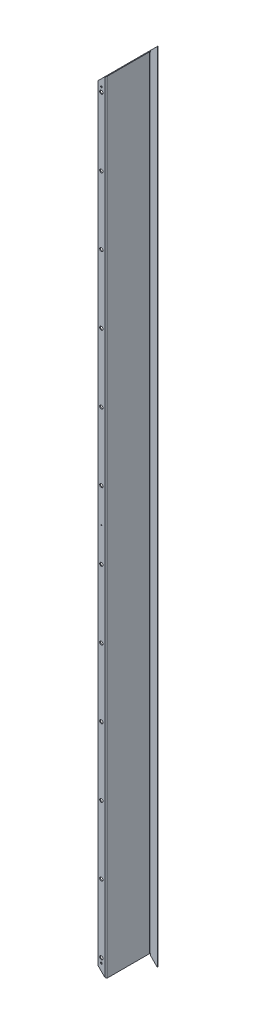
ISO-10303-21;
HEADER;
FILE_DESCRIPTION(('STEP AP214'),'2;1');
FILE_NAME('part.step','',(''),(''),'','','');
FILE_SCHEMA(('AUTOMOTIVE_DESIGN { 1 0 10303 214 1 1 1 1 }'));
ENDSEC;
DATA;
#1=APPLICATION_CONTEXT('core data for automotive mechanical design processes');
#2=APPLICATION_PROTOCOL_DEFINITION('international standard','automotive_design',2000,#1);
#3=PRODUCT_CONTEXT('',#1,'mechanical');
#4=PRODUCT('Part','Part','',(#3));
#5=PRODUCT_RELATED_PRODUCT_CATEGORY('part','',(#4));
#6=PRODUCT_DEFINITION_FORMATION('','',#4);
#7=PRODUCT_DEFINITION_CONTEXT('part definition',#1,'design');
#8=PRODUCT_DEFINITION('design','',#6,#7);
#9=PRODUCT_DEFINITION_SHAPE('','',#8);
#10=(LENGTH_UNIT() NAMED_UNIT(*) SI_UNIT(.MILLI.,.METRE.));
#11=(NAMED_UNIT(*) PLANE_ANGLE_UNIT() SI_UNIT($,.RADIAN.));
#12=(NAMED_UNIT(*) SI_UNIT($,.STERADIAN.) SOLID_ANGLE_UNIT());
#13=UNCERTAINTY_MEASURE_WITH_UNIT(LENGTH_MEASURE(1.E-05),#10,'distance_accuracy_value','');
#14=(GEOMETRIC_REPRESENTATION_CONTEXT(3) GLOBAL_UNCERTAINTY_ASSIGNED_CONTEXT((#13)) GLOBAL_UNIT_ASSIGNED_CONTEXT((#10,
#11,#12)) REPRESENTATION_CONTEXT('',''));
#15=CARTESIAN_POINT('',(0.,0.,0.));
#16=DIRECTION('',(0.,0.,1.));
#17=DIRECTION('',(1.,0.,0.));
#18=AXIS2_PLACEMENT_3D('',#15,#16,#17);
#19=CARTESIAN_POINT('',(166.5,709.,-79.3));
#20=DIRECTION('',(0.,1.,0.));
#21=DIRECTION('',(0.,0.,1.));
#22=AXIS2_PLACEMENT_3D('',#19,#20,#21);
#23=PLANE('',#22);
#24=DIRECTION('',(0.,0.,-1.));
#25=VECTOR('',#24,1.);
#26=CARTESIAN_POINT('',(166.5,709.,-79.3));
#27=LINE('',#26,#25);
#28=CARTESIAN_POINT('',(166.5,709.,-0.999999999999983));
#29=VERTEX_POINT('',#28);
#30=CARTESIAN_POINT('',(166.5,709.,-76.8));
#31=VERTEX_POINT('',#30);
#32=EDGE_CURVE('E256',#29,#31,#27,.T.);
#33=ORIENTED_EDGE('',*,*,#32,.T.);
#34=DIRECTION('',(-1.,0.,0.));
#35=VECTOR('',#34,1.);
#36=CARTESIAN_POINT('',(166.5,709.,-76.8));
#37=LINE('',#36,#35);
#38=CARTESIAN_POINT('',(165.,709.,-76.8));
#39=VERTEX_POINT('',#38);
#40=EDGE_CURVE('E231',#31,#39,#37,.T.);
#41=ORIENTED_EDGE('',*,*,#40,.T.);
#42=DIRECTION('',(0.,0.,1.));
#43=VECTOR('',#42,1.);
#44=CARTESIAN_POINT('',(165.,709.,5.82762085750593E-13));
#45=LINE('',#44,#43);
#46=CARTESIAN_POINT('',(165.,709.,-0.999999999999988));
#47=VERTEX_POINT('',#46);
#48=EDGE_CURVE('E260',#47,#39,#45,.F.);
#49=ORIENTED_EDGE('',*,*,#48,.F.);
#50=DIRECTION('',(1.,0.,0.));
#51=VECTOR('',#50,1.);
#52=CARTESIAN_POINT('',(166.5,709.,-1.));
#53=LINE('',#52,#51);
#54=EDGE_CURVE('E251',#47,#29,#53,.T.);
#55=ORIENTED_EDGE('',*,*,#54,.T.);
#56=EDGE_LOOP('',(#33,#41,#49,#55));
#57=FACE_BOUND('',#56,.T.);
#58=ADVANCED_FACE('F78',(#57),#23,.T.);
#59=CARTESIAN_POINT('',(166.5,0.,5.87999307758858E-13));
#60=DIRECTION('',(1.,0.,0.));
#61=DIRECTION('',(0.,0.,-1.));
#62=AXIS2_PLACEMENT_3D('',#59,#60,#61);
#63=PLANE('',#62);
#64=DIRECTION('',(0.,0.,1.));
#65=VECTOR('',#64,1.);
#66=CARTESIAN_POINT('',(166.5,-709.,2.65995141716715E-13));
#67=LINE('',#66,#65);
#68=CARTESIAN_POINT('',(166.5,-709.,-76.8));
#69=VERTEX_POINT('',#68);
#70=CARTESIAN_POINT('',(166.5,-709.,-0.999999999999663));
#71=VERTEX_POINT('',#70);
#72=EDGE_CURVE('E253',#69,#71,#67,.T.);
#73=ORIENTED_EDGE('',*,*,#72,.F.);
#74=DIRECTION('',(0.,1.,0.));
#75=VECTOR('',#74,1.);
#76=CARTESIAN_POINT('',(166.5,709.,-76.8));
#77=LINE('',#76,#75);
#78=EDGE_CURVE('E102',#31,#69,#77,.F.);
#79=ORIENTED_EDGE('',*,*,#78,.F.);
#80=ORIENTED_EDGE('',*,*,#32,.F.);
#81=DIRECTION('',(0.,-1.,0.));
#82=VECTOR('',#81,1.);
#83=CARTESIAN_POINT('',(166.5,0.,-0.999999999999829));
#84=LINE('',#83,#82);
#85=EDGE_CURVE('E263',#29,#71,#84,.T.);
#86=ORIENTED_EDGE('',*,*,#85,.T.);
#87=EDGE_LOOP('',(#73,#79,#80,#86));
#88=FACE_BOUND('',#87,.T.);
#89=ADVANCED_FACE('F367',(#88),#63,.T.);
#90=CARTESIAN_POINT('',(165.,0.,5.82762085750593E-13));
#91=DIRECTION('',(1.,0.,0.));
#92=DIRECTION('',(0.,0.,-1.));
#93=AXIS2_PLACEMENT_3D('',#90,#91,#92);
#94=PLANE('',#93);
#95=DIRECTION('',(0.,1.,0.));
#96=VECTOR('',#95,1.);
#97=CARTESIAN_POINT('',(165.,709.,-76.8));
#98=LINE('',#97,#96);
#99=CARTESIAN_POINT('',(165.,-709.,-76.8));
#100=VERTEX_POINT('',#99);
#101=EDGE_CURVE('E226',#39,#100,#98,.F.);
#102=ORIENTED_EDGE('',*,*,#101,.T.);
#103=DIRECTION('',(0.,0.,-1.));
#104=VECTOR('',#103,1.);
#105=CARTESIAN_POINT('',(165.,-709.,1.5753826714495E-12));
#106=LINE('',#105,#104);
#107=CARTESIAN_POINT('',(165.,-709.,-0.999999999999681));
#108=VERTEX_POINT('',#107);
#109=EDGE_CURVE('E258',#100,#108,#106,.F.);
#110=ORIENTED_EDGE('',*,*,#109,.T.);
#111=DIRECTION('',(0.,1.,0.));
#112=VECTOR('',#111,1.);
#113=CARTESIAN_POINT('',(165.,709.,-1.));
#114=LINE('',#113,#112);
#115=EDGE_CURVE('E269',#47,#108,#114,.F.);
#116=ORIENTED_EDGE('',*,*,#115,.F.);
#117=ORIENTED_EDGE('',*,*,#48,.T.);
#118=EDGE_LOOP('',(#102,#110,#116,#117));
#119=FACE_BOUND('',#118,.T.);
#120=ADVANCED_FACE('F356',(#119),#94,.F.);
#121=CARTESIAN_POINT('',(166.5,-710.5,1.5));
#122=DIRECTION('',(0.707106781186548,0.707106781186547,0.));
#123=DIRECTION('',(-0.707106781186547,0.707106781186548,0.));
#124=AXIS2_PLACEMENT_3D('',#121,#122,#123);
#125=PLANE('',#124);
#126=DIRECTION('',(0.,0.,1.));
#127=VECTOR('',#126,1.);
#128=CARTESIAN_POINT('',(164.,-708.,3.16587034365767E-13));
#129=LINE('',#128,#127);
#130=CARTESIAN_POINT('',(164.,-708.,3.16587034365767E-13));
#131=VERTEX_POINT('',#130);
#132=CARTESIAN_POINT('',(164.,-708.,1.50000000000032));
#133=VERTEX_POINT('',#132);
#134=EDGE_CURVE('E286',#131,#133,#129,.T.);
#135=ORIENTED_EDGE('',*,*,#134,.T.);
#136=DIRECTION('',(0.707106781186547,-0.707106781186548,0.));
#137=VECTOR('',#136,1.);
#138=CARTESIAN_POINT('',(166.5,-710.5,1.5));
#139=LINE('',#138,#137);
#140=CARTESIAN_POINT('',(151.5,-695.5,1.5));
#141=VERTEX_POINT('',#140);
#142=EDGE_CURVE('E886',#141,#133,#139,.T.);
#143=ORIENTED_EDGE('',*,*,#142,.F.);
#144=DIRECTION('',(0.,0.,-1.));
#145=VECTOR('',#144,1.);
#146=CARTESIAN_POINT('',(151.5,-695.5,1.5));
#147=LINE('',#146,#145);
#148=CARTESIAN_POINT('',(151.5,-695.5,0.));
#149=VERTEX_POINT('',#148);
#150=EDGE_CURVE('E285',#141,#149,#147,.T.);
#151=ORIENTED_EDGE('',*,*,#150,.T.);
#152=DIRECTION('',(0.707106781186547,-0.707106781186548,0.));
#153=VECTOR('',#152,1.);
#154=CARTESIAN_POINT('',(166.5,-710.5,0.));
#155=LINE('',#154,#153);
#156=EDGE_CURVE('E891',#149,#131,#155,.T.);
#157=ORIENTED_EDGE('',*,*,#156,.T.);
#158=EDGE_LOOP('',(#135,#143,#151,#157));
#159=FACE_BOUND('',#158,.T.);
#160=ADVANCED_FACE('F353',(#159),#125,.F.);
#161=CARTESIAN_POINT('',(0.,0.,1.5));
#162=DIRECTION('',(0.,0.,1.));
#163=DIRECTION('',(1.,0.,0.));
#164=AXIS2_PLACEMENT_3D('',#161,#162,#163);
#165=PLANE('',#164);
#166=CARTESIAN_POINT('',(157.749999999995,680.499999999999,1.5));
#167=DIRECTION('',(0.,0.,1.));
#168=DIRECTION('',(1.,0.,0.));
#169=AXIS2_PLACEMENT_3D('',#166,#167,#168);
#170=CIRCLE('',#169,2.99999999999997);
#171=CARTESIAN_POINT('',(160.749999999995,680.499999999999,1.5));
#172=VERTEX_POINT('',#171);
#173=EDGE_CURVE('E401',#172,#172,#170,.T.);
#174=ORIENTED_EDGE('',*,*,#173,.F.);
#175=EDGE_LOOP('',(#174));
#176=FACE_BOUND('',#175,.T.);
#177=CARTESIAN_POINT('',(157.749999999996,556.772727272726,1.5));
#178=DIRECTION('',(0.,0.,1.));
#179=DIRECTION('',(1.,0.,0.));
#180=AXIS2_PLACEMENT_3D('',#177,#178,#179);
#181=CIRCLE('',#180,2.99999999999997);
#182=CARTESIAN_POINT('',(160.749999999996,556.772727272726,1.5));
#183=VERTEX_POINT('',#182);
#184=EDGE_CURVE('E417',#183,#183,#181,.T.);
#185=ORIENTED_EDGE('',*,*,#184,.F.);
#186=EDGE_LOOP('',(#185));
#187=FACE_BOUND('',#186,.T.);
#188=CARTESIAN_POINT('',(157.749999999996,433.045454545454,1.5));
#189=DIRECTION('',(0.,0.,1.));
#190=DIRECTION('',(1.,0.,0.));
#191=AXIS2_PLACEMENT_3D('',#188,#189,#190);
#192=CIRCLE('',#191,2.99999999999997);
#193=CARTESIAN_POINT('',(160.749999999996,433.045454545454,1.5));
#194=VERTEX_POINT('',#193);
#195=EDGE_CURVE('E421',#194,#194,#192,.T.);
#196=ORIENTED_EDGE('',*,*,#195,.F.);
#197=EDGE_LOOP('',(#196));
#198=FACE_BOUND('',#197,.T.);
#199=CARTESIAN_POINT('',(157.749999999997,309.318181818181,1.5));
#200=DIRECTION('',(0.,0.,1.));
#201=DIRECTION('',(1.,0.,0.));
#202=AXIS2_PLACEMENT_3D('',#199,#200,#201);
#203=CIRCLE('',#202,2.99999999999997);
#204=CARTESIAN_POINT('',(160.749999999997,309.318181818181,1.5));
#205=VERTEX_POINT('',#204);
#206=EDGE_CURVE('E425',#205,#205,#203,.T.);
#207=ORIENTED_EDGE('',*,*,#206,.F.);
#208=EDGE_LOOP('',(#207));
#209=FACE_BOUND('',#208,.T.);
#210=CARTESIAN_POINT('',(157.749999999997,185.590909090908,1.5));
#211=DIRECTION('',(0.,0.,1.));
#212=DIRECTION('',(1.,0.,0.));
#213=AXIS2_PLACEMENT_3D('',#210,#211,#212);
#214=CIRCLE('',#213,2.99999999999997);
#215=CARTESIAN_POINT('',(160.749999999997,185.590909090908,1.5));
#216=VERTEX_POINT('',#215);
#217=EDGE_CURVE('E429',#216,#216,#214,.T.);
#218=ORIENTED_EDGE('',*,*,#217,.F.);
#219=EDGE_LOOP('',(#218));
#220=FACE_BOUND('',#219,.T.);
#221=CARTESIAN_POINT('',(157.749999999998,61.8636363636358,1.5));
#222=DIRECTION('',(0.,0.,1.));
#223=DIRECTION('',(1.,0.,0.));
#224=AXIS2_PLACEMENT_3D('',#221,#222,#223);
#225=CIRCLE('',#224,2.99999999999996);
#226=CARTESIAN_POINT('',(160.749999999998,61.8636363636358,1.5));
#227=VERTEX_POINT('',#226);
#228=EDGE_CURVE('E433',#227,#227,#225,.T.);
#229=ORIENTED_EDGE('',*,*,#228,.F.);
#230=EDGE_LOOP('',(#229));
#231=FACE_BOUND('',#230,.T.);
#232=CARTESIAN_POINT('',(157.749999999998,-61.8636363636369,1.5));
#233=DIRECTION('',(0.,0.,1.));
#234=DIRECTION('',(1.,0.,0.));
#235=AXIS2_PLACEMENT_3D('',#232,#233,#234);
#236=CIRCLE('',#235,2.99999999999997);
#237=CARTESIAN_POINT('',(160.749999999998,-61.8636363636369,1.5));
#238=VERTEX_POINT('',#237);
#239=EDGE_CURVE('E437',#238,#238,#236,.T.);
#240=ORIENTED_EDGE('',*,*,#239,.F.);
#241=EDGE_LOOP('',(#240));
#242=FACE_BOUND('',#241,.T.);
#243=CARTESIAN_POINT('',(157.75,-680.5,1.5));
#244=DIRECTION('',(0.,0.,1.));
#245=DIRECTION('',(1.,0.,0.));
#246=AXIS2_PLACEMENT_3D('',#243,#244,#245);
#247=CIRCLE('',#246,2.99999999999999);
#248=CARTESIAN_POINT('',(160.75,-680.5,1.5));
#249=VERTEX_POINT('',#248);
#250=EDGE_CURVE('E441',#249,#249,#247,.T.);
#251=ORIENTED_EDGE('',*,*,#250,.F.);
#252=EDGE_LOOP('',(#251));
#253=FACE_BOUND('',#252,.T.);
#254=CARTESIAN_POINT('',(157.75,-556.772727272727,1.5));
#255=DIRECTION('',(0.,0.,1.));
#256=DIRECTION('',(1.,0.,0.));
#257=AXIS2_PLACEMENT_3D('',#254,#255,#256);
#258=CIRCLE('',#257,2.99999999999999);
#259=CARTESIAN_POINT('',(160.75,-556.772727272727,1.5));
#260=VERTEX_POINT('',#259);
#261=EDGE_CURVE('E445',#260,#260,#258,.T.);
#262=ORIENTED_EDGE('',*,*,#261,.F.);
#263=EDGE_LOOP('',(#262));
#264=FACE_BOUND('',#263,.T.);
#265=CARTESIAN_POINT('',(157.749999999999,-433.045454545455,1.5));
#266=DIRECTION('',(0.,0.,1.));
#267=DIRECTION('',(1.,0.,0.));
#268=AXIS2_PLACEMENT_3D('',#265,#266,#267);
#269=CIRCLE('',#268,2.99999999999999);
#270=CARTESIAN_POINT('',(160.749999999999,-433.045454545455,1.5));
#271=VERTEX_POINT('',#270);
#272=EDGE_CURVE('E449',#271,#271,#269,.T.);
#273=ORIENTED_EDGE('',*,*,#272,.F.);
#274=EDGE_LOOP('',(#273));
#275=FACE_BOUND('',#274,.T.);
#276=CARTESIAN_POINT('',(157.749999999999,-309.318181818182,1.5));
#277=DIRECTION('',(0.,0.,1.));
#278=DIRECTION('',(1.,0.,0.));
#279=AXIS2_PLACEMENT_3D('',#276,#277,#278);
#280=CIRCLE('',#279,2.99999999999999);
#281=CARTESIAN_POINT('',(160.749999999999,-309.318181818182,1.5));
#282=VERTEX_POINT('',#281);
#283=EDGE_CURVE('E453',#282,#282,#280,.T.);
#284=ORIENTED_EDGE('',*,*,#283,.F.);
#285=EDGE_LOOP('',(#284));
#286=FACE_BOUND('',#285,.T.);
#287=CARTESIAN_POINT('',(157.749999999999,-185.59090909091,1.5));
#288=DIRECTION('',(0.,0.,1.));
#289=DIRECTION('',(1.,0.,0.));
#290=AXIS2_PLACEMENT_3D('',#287,#288,#289);
#291=CIRCLE('',#290,2.99999999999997);
#292=CARTESIAN_POINT('',(160.749999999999,-185.59090909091,1.5));
#293=VERTEX_POINT('',#292);
#294=EDGE_CURVE('E457',#293,#293,#291,.T.);
#295=ORIENTED_EDGE('',*,*,#294,.F.);
#296=EDGE_LOOP('',(#295));
#297=FACE_BOUND('',#296,.T.);
#298=CARTESIAN_POINT('',(157.75,-689.,1.5));
#299=DIRECTION('',(0.,0.,1.));
#300=DIRECTION('',(1.,0.,0.));
#301=AXIS2_PLACEMENT_3D('',#298,#299,#300);
#302=CIRCLE('',#301,1.50000000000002);
#303=CARTESIAN_POINT('',(159.25,-689.,1.5));
#304=VERTEX_POINT('',#303);
#305=EDGE_CURVE('E410',#304,#304,#302,.T.);
#306=ORIENTED_EDGE('',*,*,#305,.F.);
#307=EDGE_LOOP('',(#306));
#308=FACE_BOUND('',#307,.T.);
#309=CARTESIAN_POINT('',(157.749999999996,689.,1.5));
#310=DIRECTION('',(0.,0.,1.));
#311=DIRECTION('',(1.,0.,0.));
#312=AXIS2_PLACEMENT_3D('',#309,#310,#311);
#313=CIRCLE('',#312,1.50000000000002);
#314=CARTESIAN_POINT('',(159.249999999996,689.,1.5));
#315=VERTEX_POINT('',#314);
#316=EDGE_CURVE('E404',#315,#315,#313,.T.);
#317=ORIENTED_EDGE('',*,*,#316,.F.);
#318=EDGE_LOOP('',(#317));
#319=FACE_BOUND('',#318,.T.);
#320=CARTESIAN_POINT('',(157.75,0.,1.5));
#321=DIRECTION('',(0.,0.,1.));
#322=DIRECTION('',(1.,0.,0.));
#323=AXIS2_PLACEMENT_3D('',#320,#321,#322);
#324=CIRCLE('',#323,0.999999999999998);
#325=CARTESIAN_POINT('',(158.75,0.,1.5));
#326=VERTEX_POINT('',#325);
#327=EDGE_CURVE('E397',#326,#326,#324,.T.);
#328=ORIENTED_EDGE('',*,*,#327,.F.);
#329=EDGE_LOOP('',(#328));
#330=FACE_BOUND('',#329,.T.);
#331=ORIENTED_EDGE('',*,*,#142,.T.);
#332=DIRECTION('',(0.,-1.,0.));
#333=VECTOR('',#332,1.);
#334=CARTESIAN_POINT('',(164.,-709.,1.50000000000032));
#335=LINE('',#334,#333);
#336=CARTESIAN_POINT('',(164.000000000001,708.,1.5));
#337=VERTEX_POINT('',#336);
#338=EDGE_CURVE('E277',#133,#337,#335,.F.);
#339=ORIENTED_EDGE('',*,*,#338,.T.);
#340=DIRECTION('',(-0.707106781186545,-0.70710678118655,0.));
#341=VECTOR('',#340,1.);
#342=CARTESIAN_POINT('',(166.5,710.5,1.5));
#343=LINE('',#342,#341);
#344=CARTESIAN_POINT('',(151.5,695.5,1.5));
#345=VERTEX_POINT('',#344);
#346=EDGE_CURVE('E883',#337,#345,#343,.T.);
#347=ORIENTED_EDGE('',*,*,#346,.T.);
#348=DIRECTION('',(0.,-1.,0.));
#349=VECTOR('',#348,1.);
#350=CARTESIAN_POINT('',(151.5,-695.5,1.5));
#351=LINE('',#350,#349);
#352=EDGE_CURVE('E888',#345,#141,#351,.T.);
#353=ORIENTED_EDGE('',*,*,#352,.T.);
#354=EDGE_LOOP('',(#331,#339,#347,#353));
#355=FACE_BOUND('',#354,.T.);
#356=ADVANCED_FACE('F355',(#176,#187,#198,#209,#220,#231,#242,#253,#264,#275,#286,#297,#308,
#319,#330,#355),#165,.T.);
#357=CARTESIAN_POINT('',(0.,0.,0.));
#358=DIRECTION('',(0.,0.,1.));
#359=DIRECTION('',(1.,0.,0.));
#360=AXIS2_PLACEMENT_3D('',#357,#358,#359);
#361=PLANE('',#360);
#362=CARTESIAN_POINT('',(157.749999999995,680.499999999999,0.));
#363=DIRECTION('',(0.,0.,1.));
#364=DIRECTION('',(1.,0.,0.));
#365=AXIS2_PLACEMENT_3D('',#362,#363,#364);
#366=CIRCLE('',#365,2.99999999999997);
#367=CARTESIAN_POINT('',(160.749999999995,680.499999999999,0.));
#368=VERTEX_POINT('',#367);
#369=EDGE_CURVE('E82',#368,#368,#366,.T.);
#370=ORIENTED_EDGE('',*,*,#369,.T.);
#371=EDGE_LOOP('',(#370));
#372=FACE_BOUND('',#371,.T.);
#373=CARTESIAN_POINT('',(157.749999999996,556.772727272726,0.));
#374=DIRECTION('',(0.,0.,1.));
#375=DIRECTION('',(1.,0.,0.));
#376=AXIS2_PLACEMENT_3D('',#373,#374,#375);
#377=CIRCLE('',#376,2.99999999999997);
#378=CARTESIAN_POINT('',(160.749999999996,556.772727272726,0.));
#379=VERTEX_POINT('',#378);
#380=EDGE_CURVE('E420',#379,#379,#377,.T.);
#381=ORIENTED_EDGE('',*,*,#380,.T.);
#382=EDGE_LOOP('',(#381));
#383=FACE_BOUND('',#382,.T.);
#384=CARTESIAN_POINT('',(157.749999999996,433.045454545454,0.));
#385=DIRECTION('',(0.,0.,1.));
#386=DIRECTION('',(1.,0.,0.));
#387=AXIS2_PLACEMENT_3D('',#384,#385,#386);
#388=CIRCLE('',#387,2.99999999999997);
#389=CARTESIAN_POINT('',(160.749999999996,433.045454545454,0.));
#390=VERTEX_POINT('',#389);
#391=EDGE_CURVE('E424',#390,#390,#388,.T.);
#392=ORIENTED_EDGE('',*,*,#391,.T.);
#393=EDGE_LOOP('',(#392));
#394=FACE_BOUND('',#393,.T.);
#395=CARTESIAN_POINT('',(157.749999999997,309.318181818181,0.));
#396=DIRECTION('',(0.,0.,1.));
#397=DIRECTION('',(1.,0.,0.));
#398=AXIS2_PLACEMENT_3D('',#395,#396,#397);
#399=CIRCLE('',#398,2.99999999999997);
#400=CARTESIAN_POINT('',(160.749999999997,309.318181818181,0.));
#401=VERTEX_POINT('',#400);
#402=EDGE_CURVE('E428',#401,#401,#399,.T.);
#403=ORIENTED_EDGE('',*,*,#402,.T.);
#404=EDGE_LOOP('',(#403));
#405=FACE_BOUND('',#404,.T.);
#406=CARTESIAN_POINT('',(157.749999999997,185.590909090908,0.));
#407=DIRECTION('',(0.,0.,1.));
#408=DIRECTION('',(1.,0.,0.));
#409=AXIS2_PLACEMENT_3D('',#406,#407,#408);
#410=CIRCLE('',#409,2.99999999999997);
#411=CARTESIAN_POINT('',(160.749999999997,185.590909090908,0.));
#412=VERTEX_POINT('',#411);
#413=EDGE_CURVE('E432',#412,#412,#410,.T.);
#414=ORIENTED_EDGE('',*,*,#413,.T.);
#415=EDGE_LOOP('',(#414));
#416=FACE_BOUND('',#415,.T.);
#417=CARTESIAN_POINT('',(157.749999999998,61.8636363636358,0.));
#418=DIRECTION('',(0.,0.,1.));
#419=DIRECTION('',(1.,0.,0.));
#420=AXIS2_PLACEMENT_3D('',#417,#418,#419);
#421=CIRCLE('',#420,2.99999999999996);
#422=CARTESIAN_POINT('',(160.749999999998,61.8636363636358,0.));
#423=VERTEX_POINT('',#422);
#424=EDGE_CURVE('E436',#423,#423,#421,.T.);
#425=ORIENTED_EDGE('',*,*,#424,.T.);
#426=EDGE_LOOP('',(#425));
#427=FACE_BOUND('',#426,.T.);
#428=CARTESIAN_POINT('',(157.749999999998,-61.8636363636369,0.));
#429=DIRECTION('',(0.,0.,1.));
#430=DIRECTION('',(1.,0.,0.));
#431=AXIS2_PLACEMENT_3D('',#428,#429,#430);
#432=CIRCLE('',#431,2.99999999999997);
#433=CARTESIAN_POINT('',(160.749999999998,-61.8636363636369,0.));
#434=VERTEX_POINT('',#433);
#435=EDGE_CURVE('E440',#434,#434,#432,.T.);
#436=ORIENTED_EDGE('',*,*,#435,.T.);
#437=EDGE_LOOP('',(#436));
#438=FACE_BOUND('',#437,.T.);
#439=CARTESIAN_POINT('',(157.75,-680.5,0.));
#440=DIRECTION('',(0.,0.,1.));
#441=DIRECTION('',(1.,0.,0.));
#442=AXIS2_PLACEMENT_3D('',#439,#440,#441);
#443=CIRCLE('',#442,2.99999999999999);
#444=CARTESIAN_POINT('',(160.75,-680.5,0.));
#445=VERTEX_POINT('',#444);
#446=EDGE_CURVE('E444',#445,#445,#443,.T.);
#447=ORIENTED_EDGE('',*,*,#446,.T.);
#448=EDGE_LOOP('',(#447));
#449=FACE_BOUND('',#448,.T.);
#450=CARTESIAN_POINT('',(157.75,-556.772727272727,0.));
#451=DIRECTION('',(0.,0.,1.));
#452=DIRECTION('',(1.,0.,0.));
#453=AXIS2_PLACEMENT_3D('',#450,#451,#452);
#454=CIRCLE('',#453,2.99999999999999);
#455=CARTESIAN_POINT('',(160.75,-556.772727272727,0.));
#456=VERTEX_POINT('',#455);
#457=EDGE_CURVE('E448',#456,#456,#454,.T.);
#458=ORIENTED_EDGE('',*,*,#457,.T.);
#459=EDGE_LOOP('',(#458));
#460=FACE_BOUND('',#459,.T.);
#461=CARTESIAN_POINT('',(157.749999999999,-433.045454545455,0.));
#462=DIRECTION('',(0.,0.,1.));
#463=DIRECTION('',(1.,0.,0.));
#464=AXIS2_PLACEMENT_3D('',#461,#462,#463);
#465=CIRCLE('',#464,2.99999999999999);
#466=CARTESIAN_POINT('',(160.749999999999,-433.045454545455,0.));
#467=VERTEX_POINT('',#466);
#468=EDGE_CURVE('E452',#467,#467,#465,.T.);
#469=ORIENTED_EDGE('',*,*,#468,.T.);
#470=EDGE_LOOP('',(#469));
#471=FACE_BOUND('',#470,.T.);
#472=CARTESIAN_POINT('',(157.749999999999,-309.318181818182,0.));
#473=DIRECTION('',(0.,0.,1.));
#474=DIRECTION('',(1.,0.,0.));
#475=AXIS2_PLACEMENT_3D('',#472,#473,#474);
#476=CIRCLE('',#475,2.99999999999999);
#477=CARTESIAN_POINT('',(160.749999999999,-309.318181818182,0.));
#478=VERTEX_POINT('',#477);
#479=EDGE_CURVE('E456',#478,#478,#476,.T.);
#480=ORIENTED_EDGE('',*,*,#479,.T.);
#481=EDGE_LOOP('',(#480));
#482=FACE_BOUND('',#481,.T.);
#483=CARTESIAN_POINT('',(157.749999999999,-185.59090909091,0.));
#484=DIRECTION('',(0.,0.,1.));
#485=DIRECTION('',(1.,0.,0.));
#486=AXIS2_PLACEMENT_3D('',#483,#484,#485);
#487=CIRCLE('',#486,2.99999999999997);
#488=CARTESIAN_POINT('',(160.749999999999,-185.59090909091,0.));
#489=VERTEX_POINT('',#488);
#490=EDGE_CURVE('E459',#489,#489,#487,.T.);
#491=ORIENTED_EDGE('',*,*,#490,.T.);
#492=EDGE_LOOP('',(#491));
#493=FACE_BOUND('',#492,.T.);
#494=CARTESIAN_POINT('',(157.75,-689.,0.));
#495=DIRECTION('',(0.,0.,1.));
#496=DIRECTION('',(1.,0.,0.));
#497=AXIS2_PLACEMENT_3D('',#494,#495,#496);
#498=CIRCLE('',#497,1.50000000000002);
#499=CARTESIAN_POINT('',(159.25,-689.,0.));
#500=VERTEX_POINT('',#499);
#501=EDGE_CURVE('E195',#500,#500,#498,.T.);
#502=ORIENTED_EDGE('',*,*,#501,.T.);
#503=EDGE_LOOP('',(#502));
#504=FACE_BOUND('',#503,.T.);
#505=CARTESIAN_POINT('',(157.749999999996,689.,0.));
#506=DIRECTION('',(0.,0.,1.));
#507=DIRECTION('',(1.,0.,0.));
#508=AXIS2_PLACEMENT_3D('',#505,#506,#507);
#509=CIRCLE('',#508,1.50000000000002);
#510=CARTESIAN_POINT('',(159.249999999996,689.,0.));
#511=VERTEX_POINT('',#510);
#512=EDGE_CURVE('E407',#511,#511,#509,.T.);
#513=ORIENTED_EDGE('',*,*,#512,.T.);
#514=EDGE_LOOP('',(#513));
#515=FACE_BOUND('',#514,.T.);
#516=CARTESIAN_POINT('',(157.75,0.,0.));
#517=DIRECTION('',(0.,0.,1.));
#518=DIRECTION('',(1.,0.,0.));
#519=AXIS2_PLACEMENT_3D('',#516,#517,#518);
#520=CIRCLE('',#519,0.999999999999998);
#521=CARTESIAN_POINT('',(158.75,0.,0.));
#522=VERTEX_POINT('',#521);
#523=EDGE_CURVE('E400',#522,#522,#520,.T.);
#524=ORIENTED_EDGE('',*,*,#523,.T.);
#525=EDGE_LOOP('',(#524));
#526=FACE_BOUND('',#525,.T.);
#527=DIRECTION('',(0.,-1.,0.));
#528=VECTOR('',#527,1.);
#529=CARTESIAN_POINT('',(164.,-709.,3.16803874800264E-13));
#530=LINE('',#529,#528);
#531=CARTESIAN_POINT('',(164.,708.,0.));
#532=VERTEX_POINT('',#531);
#533=EDGE_CURVE('E274',#131,#532,#530,.F.);
#534=ORIENTED_EDGE('',*,*,#533,.F.);
#535=ORIENTED_EDGE('',*,*,#156,.F.);
#536=DIRECTION('',(0.,-1.,0.));
#537=VECTOR('',#536,1.);
#538=CARTESIAN_POINT('',(151.5,-695.5,0.));
#539=LINE('',#538,#537);
#540=CARTESIAN_POINT('',(151.5,695.5,0.));
#541=VERTEX_POINT('',#540);
#542=EDGE_CURVE('E87',#541,#149,#539,.T.);
#543=ORIENTED_EDGE('',*,*,#542,.F.);
#544=DIRECTION('',(-0.707106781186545,-0.70710678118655,0.));
#545=VECTOR('',#544,1.);
#546=CARTESIAN_POINT('',(166.5,710.5,0.));
#547=LINE('',#546,#545);
#548=EDGE_CURVE('E469',#532,#541,#547,.T.);
#549=ORIENTED_EDGE('',*,*,#548,.F.);
#550=EDGE_LOOP('',(#534,#535,#543,#549));
#551=FACE_BOUND('',#550,.T.);
#552=ADVANCED_FACE('F80',(#372,#383,#394,#405,#416,#427,#438,#449,#460,#471,#482,#493,#504,#515,
#526,#551),#361,.F.);
#553=CARTESIAN_POINT('',(166.5,710.5,1.5));
#554=DIRECTION('',(0.70710678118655,-0.707106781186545,0.));
#555=DIRECTION('',(0.707106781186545,0.70710678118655,0.));
#556=AXIS2_PLACEMENT_3D('',#553,#554,#555);
#557=PLANE('',#556);
#558=ORIENTED_EDGE('',*,*,#346,.F.);
#559=DIRECTION('',(0.,0.,1.));
#560=VECTOR('',#559,1.);
#561=CARTESIAN_POINT('',(164.,708.,0.));
#562=LINE('',#561,#560);
#563=EDGE_CURVE('E282',#532,#337,#562,.T.);
#564=ORIENTED_EDGE('',*,*,#563,.F.);
#565=ORIENTED_EDGE('',*,*,#548,.T.);
#566=DIRECTION('',(0.,0.,-1.));
#567=VECTOR('',#566,1.);
#568=CARTESIAN_POINT('',(151.5,695.5,1.5));
#569=LINE('',#568,#567);
#570=EDGE_CURVE('E13',#345,#541,#569,.T.);
#571=ORIENTED_EDGE('',*,*,#570,.F.);
#572=EDGE_LOOP('',(#558,#564,#565,#571));
#573=FACE_BOUND('',#572,.T.);
#574=ADVANCED_FACE('F348',(#573),#557,.F.);
#575=CARTESIAN_POINT('',(151.5,-695.5,1.5));
#576=DIRECTION('',(1.,0.,0.));
#577=DIRECTION('',(0.,1.,0.));
#578=AXIS2_PLACEMENT_3D('',#575,#576,#577);
#579=PLANE('',#578);
#580=ORIENTED_EDGE('',*,*,#542,.T.);
#581=ORIENTED_EDGE('',*,*,#150,.F.);
#582=ORIENTED_EDGE('',*,*,#352,.F.);
#583=ORIENTED_EDGE('',*,*,#570,.T.);
#584=EDGE_LOOP('',(#580,#581,#582,#583));
#585=FACE_BOUND('',#584,.T.);
#586=ADVANCED_FACE('F339',(#585),#579,.F.);
#587=CARTESIAN_POINT('',(164.,708.,1.51500000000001));
#588=CARTESIAN_POINT('',(164.329268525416,708.08334747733,1.51500000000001));
#589=CARTESIAN_POINT('',(164.658295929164,708.166666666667,1.44954128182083));
#590=CARTESIAN_POINT('',(165.266601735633,708.333333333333,1.19757276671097));
#591=CARTESIAN_POINT('',(165.545585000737,708.416666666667,1.01116210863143));
#592=CARTESIAN_POINT('',(166.011162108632,708.583333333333,0.545585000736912));
#593=CARTESIAN_POINT('',(166.197572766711,708.666666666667,0.266601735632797));
#594=CARTESIAN_POINT('',(166.449541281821,708.833333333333,-0.341704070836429));
#595=CARTESIAN_POINT('',(166.515,708.916652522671,-0.670731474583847));
#596=CARTESIAN_POINT('',(166.515,709.,-1.00000000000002));
#597=CARTESIAN_POINT('',(164.,708.,1.50000000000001));
#598=CARTESIAN_POINT('',(164.32730464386,708.083347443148,1.50000000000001));
#599=CARTESIAN_POINT('',(164.654369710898,708.166666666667,1.4349316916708));
#600=CARTESIAN_POINT('',(165.259047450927,708.333333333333,1.18446597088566));
#601=CARTESIAN_POINT('',(165.536366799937,708.416666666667,0.999167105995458));
#602=CARTESIAN_POINT('',(165.999167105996,708.583333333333,0.536366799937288));
#603=CARTESIAN_POINT('',(166.184465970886,708.666666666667,0.259047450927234));
#604=CARTESIAN_POINT('',(166.434931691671,708.833333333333,-0.345630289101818));
#605=CARTESIAN_POINT('',(166.5,708.916652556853,-0.672695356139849));
#606=CARTESIAN_POINT('',(166.5,709.,-1.00000000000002));
#607=CARTESIAN_POINT('',(164.,708.,0.));
#608=CARTESIAN_POINT('',(164.13091648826,708.083344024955,0.));
#609=CARTESIAN_POINT('',(164.261747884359,708.166666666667,-0.0260273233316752));
#610=CARTESIAN_POINT('',(164.503618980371,708.333333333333,-0.126213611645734));
#611=CARTESIAN_POINT('',(164.614546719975,708.416666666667,-0.200333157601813));
#612=CARTESIAN_POINT('',(164.799666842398,708.583333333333,-0.385453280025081));
#613=CARTESIAN_POINT('',(164.873786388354,708.666666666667,-0.496381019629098));
#614=CARTESIAN_POINT('',(164.973972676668,708.833333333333,-0.738252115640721));
#615=CARTESIAN_POINT('',(165.,708.916655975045,-0.869083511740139));
#616=CARTESIAN_POINT('',(165.,709.,-1.));
#617=CARTESIAN_POINT('',(164.,708.,-0.0151499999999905));
#618=CARTESIAN_POINT('',(164.128932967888,708.083343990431,-0.0151499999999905));
#619=CARTESIAN_POINT('',(164.257782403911,708.166666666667,-0.0407830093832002));
#620=CARTESIAN_POINT('',(164.495989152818,708.333333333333,-0.139451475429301));
#621=CARTESIAN_POINT('',(164.605236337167,708.416666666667,-0.212448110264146));
#622=CARTESIAN_POINT('',(164.787551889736,708.583333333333,-0.394763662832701));
#623=CARTESIAN_POINT('',(164.860548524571,708.666666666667,-0.504010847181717));
#624=CARTESIAN_POINT('',(164.959216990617,708.833333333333,-0.742217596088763));
#625=CARTESIAN_POINT('',(164.98485,708.916656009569,-0.871067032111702));
#626=CARTESIAN_POINT('',(164.98485,709.,-1.));
#627=B_SPLINE_SURFACE_WITH_KNOTS('',1,3,((#587,#588,#589,#590,#591,#592,#593,#594,#595,#596),
(#597,#598,#599,#600,#601,#602,#603,#604,#605,#606),(#607,#608,#609,#610,#611,#612,#613,#614,
#615,#616),(#617,#618,#619,#620,#621,#622,#623,#624,#625,#626)),.UNSPECIFIED.,.F.,.F.,.F.,(2,1,
1,2),(4,2,2,2,4),(-0.01,0.,1.,1.0101),(0.,0.25,0.5,0.75,1.),.UNSPECIFIED.);
#628=CARTESIAN_POINT('',(164.,708.,0.));
#629=CARTESIAN_POINT('',(164.035962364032,708.022895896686,7.59315881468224E-06));
#630=CARTESIAN_POINT('',(164.071923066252,708.045789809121,-0.00193976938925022));
#631=CARTESIAN_POINT('',(164.143426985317,708.091576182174,-0.00968794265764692));
#632=CARTESIAN_POINT('',(164.178970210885,708.114468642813,-0.0154886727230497));
#633=CARTESIAN_POINT('',(164.249174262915,708.160221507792,-0.0308756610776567));
#634=CARTESIAN_POINT('',(164.283836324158,708.183081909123,-0.0404562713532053));
#635=CARTESIAN_POINT('',(164.351918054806,708.228795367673,-0.0632799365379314));
#636=CARTESIAN_POINT('',(164.385337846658,708.251648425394,-0.0765226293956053));
#637=CARTESIAN_POINT('',(164.478590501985,708.31700031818,-0.119435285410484));
#638=CARTESIAN_POINT('',(164.536474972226,708.359526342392,-0.153449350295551));
#639=CARTESIAN_POINT('',(164.644254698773,708.444535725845,-0.232277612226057));
#640=CARTESIAN_POINT('',(164.694154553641,708.487019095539,-0.277085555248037));
#641=CARTESIAN_POINT('',(164.784051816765,708.571984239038,-0.375730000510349));
#642=CARTESIAN_POINT('',(164.824049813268,708.614466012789,-0.42956596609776));
#643=CARTESIAN_POINT('',(164.892551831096,708.699449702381,-0.544140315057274));
#644=CARTESIAN_POINT('',(164.921052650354,708.741951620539,-0.604880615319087));
#645=CARTESIAN_POINT('',(164.961973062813,708.82038478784,-0.72108615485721));
#646=CARTESIAN_POINT('',(164.976193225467,708.856319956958,-0.775923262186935));
#647=CARTESIAN_POINT('',(164.995225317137,708.928166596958,-0.887165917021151));
#648=CARTESIAN_POINT('',(165.00004360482,708.964078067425,-0.943570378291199));
#649=CARTESIAN_POINT('',(165.,709.,-1.));
#650=B_SPLINE_CURVE_WITH_KNOTS('',3,(#628,#629,#630,#631,#632,#633,#634,#635,#636,#637,#638,
#639,#640,#641,#642,#643,#644,#645,#646,#647,#648,#649),.UNSPECIFIED.,.F.,.F.,(4,2,2,2,2,2,2,2,
2,2,4),(0.,0.127848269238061,0.255693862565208,0.383349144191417,0.510991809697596,
0.748186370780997,0.985243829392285,1.22228720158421,1.45939654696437,1.65999150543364,
1.86045075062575),.UNSPECIFIED.);
#651=EDGE_CURVE('E276',#532,#47,#650,.T.);
#652=CARTESIAN_POINT('',(164.,708.,1.50000000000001));
#653=CARTESIAN_POINT('',(164.061942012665,708.015774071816,1.50000078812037));
#654=CARTESIAN_POINT('',(164.123864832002,708.031543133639,1.49769714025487));
#655=CARTESIAN_POINT('',(164.247360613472,708.063078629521,1.48850298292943));
#656=CARTESIAN_POINT('',(164.308933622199,708.078845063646,1.48161309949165));
#657=CARTESIAN_POINT('',(164.492662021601,708.126151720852,1.45409978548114));
#658=CARTESIAN_POINT('',(164.613851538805,708.157705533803,1.42663267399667));
#659=CARTESIAN_POINT('',(164.871042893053,708.226204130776,1.34783427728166));
#660=CARTESIAN_POINT('',(165.00604666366,708.263150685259,1.29323232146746));
#661=CARTESIAN_POINT('',(165.264561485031,708.337039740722,1.16146616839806));
#662=CARTESIAN_POINT('',(165.388071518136,708.373982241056,1.08429997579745));
#663=CARTESIAN_POINT('',(165.619853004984,708.447870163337,0.909744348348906));
#664=CARTESIAN_POINT('',(165.728125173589,708.484815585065,0.812355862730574));
#665=CARTESIAN_POINT('',(165.926176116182,708.558709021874,0.600279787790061));
#666=CARTESIAN_POINT('',(166.015952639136,708.595657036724,0.485590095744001));
#667=CARTESIAN_POINT('',(166.174295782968,708.669558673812,0.242379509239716));
#668=CARTESIAN_POINT('',(166.24285778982,708.706512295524,0.113855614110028));
#669=CARTESIAN_POINT('',(166.35664808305,708.780412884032,-0.153104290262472));
#670=CARTESIAN_POINT('',(166.401889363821,708.817359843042,-0.291534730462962));
#671=CARTESIAN_POINT('',(166.456458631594,708.878590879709,-0.525718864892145));
#672=CARTESIAN_POINT('',(166.472775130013,708.902889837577,-0.619899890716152));
#673=CARTESIAN_POINT('',(166.494545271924,708.951454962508,-0.809374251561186));
#674=CARTESIAN_POINT('',(166.500014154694,708.975721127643,-0.90466583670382));
#675=CARTESIAN_POINT('',(166.5,709.,-1.00000000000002));
#676=B_SPLINE_CURVE_WITH_KNOTS('',3,(#652,#653,#654,#655,#656,#657,#658,#659,#660,#661,#662,
#663,#664,#665,#666,#667,#668,#669,#670,#671,#672,#673,#674,#675),.UNSPECIFIED.,.F.,.F.,(4,2,2,
2,2,2,2,2,2,2,2,4),(0.,0.191675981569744,0.383325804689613,0.766549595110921,1.21512109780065,
1.66373227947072,2.11232240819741,2.56096710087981,3.009709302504,3.45820119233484,
3.75350969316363,4.04840303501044),.UNSPECIFIED.);
#677=EDGE_CURVE('E280',#337,#29,#676,.T.);
#678=ORIENTED_EDGE('',*,*,#54,.F.);
#679=ORIENTED_EDGE('',*,*,#651,.F.);
#680=ORIENTED_EDGE('',*,*,#563,.T.);
#681=ORIENTED_EDGE('',*,*,#677,.T.);
#682=EDGE_LOOP('',(#678,#679,#680,#681));
#683=FACE_BOUND('',#682,.T.);
#684=ADVANCED_FACE('F303',(#683),#627,.F.);
#685=CARTESIAN_POINT('',(166.515,-709.,-0.999999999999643));
#686=CARTESIAN_POINT('',(166.515,-708.91665252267,-0.670731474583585));
#687=CARTESIAN_POINT('',(166.449541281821,-708.833333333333,-0.341704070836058));
#688=CARTESIAN_POINT('',(166.197572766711,-708.666666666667,0.266601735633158));
#689=CARTESIAN_POINT('',(166.011162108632,-708.583333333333,0.545585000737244));
#690=CARTESIAN_POINT('',(165.545585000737,-708.416666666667,1.01116210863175));
#691=CARTESIAN_POINT('',(165.266601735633,-708.333333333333,1.19757276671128));
#692=CARTESIAN_POINT('',(164.658295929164,-708.166666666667,1.44954128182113));
#693=CARTESIAN_POINT('',(164.329268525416,-708.08334747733,1.51500000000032));
#694=CARTESIAN_POINT('',(164.,-708.,1.51500000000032));
#695=CARTESIAN_POINT('',(166.5,-709.,-0.999999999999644));
#696=CARTESIAN_POINT('',(166.5,-708.916652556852,-0.672695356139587));
#697=CARTESIAN_POINT('',(166.434931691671,-708.833333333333,-0.345630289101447));
#698=CARTESIAN_POINT('',(166.184465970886,-708.666666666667,0.259047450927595));
#699=CARTESIAN_POINT('',(165.999167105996,-708.583333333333,0.53636679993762));
#700=CARTESIAN_POINT('',(165.536366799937,-708.416666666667,0.999167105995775));
#701=CARTESIAN_POINT('',(165.259047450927,-708.333333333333,1.18446597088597));
#702=CARTESIAN_POINT('',(164.654369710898,-708.166666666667,1.43493169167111));
#703=CARTESIAN_POINT('',(164.32730464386,-708.083347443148,1.50000000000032));
#704=CARTESIAN_POINT('',(164.,-708.,1.50000000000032));
#705=CARTESIAN_POINT('',(165.,-709.,-0.999999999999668));
#706=CARTESIAN_POINT('',(165.,-708.916655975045,-0.869083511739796));
#707=CARTESIAN_POINT('',(164.973972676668,-708.833333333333,-0.738252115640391));
#708=CARTESIAN_POINT('',(164.873786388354,-708.666666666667,-0.496381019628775));
#709=CARTESIAN_POINT('',(164.799666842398,-708.583333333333,-0.385453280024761));
#710=CARTESIAN_POINT('',(164.614546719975,-708.416666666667,-0.200333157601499));
#711=CARTESIAN_POINT('',(164.503618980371,-708.333333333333,-0.126213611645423));
#712=CARTESIAN_POINT('',(164.261747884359,-708.166666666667,-0.0260273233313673));
#713=CARTESIAN_POINT('',(164.13091648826,-708.083344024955,3.16619268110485E-13));
#714=CARTESIAN_POINT('',(164.,-708.,3.16587034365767E-13));
#715=CARTESIAN_POINT('',(164.98485,-709.,-0.999999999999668));
#716=CARTESIAN_POINT('',(164.98485,-708.916656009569,-0.871067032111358));
#717=CARTESIAN_POINT('',(164.959216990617,-708.833333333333,-0.742217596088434));
#718=CARTESIAN_POINT('',(164.860548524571,-708.666666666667,-0.504010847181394));
#719=CARTESIAN_POINT('',(164.787551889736,-708.583333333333,-0.394763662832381));
#720=CARTESIAN_POINT('',(164.605236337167,-708.416666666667,-0.212448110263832));
#721=CARTESIAN_POINT('',(164.495989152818,-708.333333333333,-0.13945147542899));
#722=CARTESIAN_POINT('',(164.257782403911,-708.166666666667,-0.0407830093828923));
#723=CARTESIAN_POINT('',(164.128932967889,-708.083343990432,-0.0151499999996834));
#724=CARTESIAN_POINT('',(164.,-708.,-0.0151499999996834));
#725=B_SPLINE_SURFACE_WITH_KNOTS('',1,3,((#685,#686,#687,#688,#689,#690,#691,#692,#693,#694),
(#695,#696,#697,#698,#699,#700,#701,#702,#703,#704),(#705,#706,#707,#708,#709,#710,#711,#712,
#713,#714),(#715,#716,#717,#718,#719,#720,#721,#722,#723,#724)),.UNSPECIFIED.,.F.,.F.,.F.,(2,1,
1,2),(4,2,2,2,4),(-0.01,0.,1.,1.0101),(0.,0.25,0.5,0.75,1.),.UNSPECIFIED.);
#726=CARTESIAN_POINT('',(165.,-709.,-0.999999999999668));
#727=CARTESIAN_POINT('',(165.000007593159,-708.977104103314,-0.964037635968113));
#728=CARTESIAN_POINT('',(164.998060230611,-708.954210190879,-0.928076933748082));
#729=CARTESIAN_POINT('',(164.990312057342,-708.908423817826,-0.85657301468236));
#730=CARTESIAN_POINT('',(164.984511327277,-708.885531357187,-0.821029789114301));
#731=CARTESIAN_POINT('',(164.969124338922,-708.839778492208,-0.750825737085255));
#732=CARTESIAN_POINT('',(164.959543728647,-708.816918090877,-0.716163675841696));
#733=CARTESIAN_POINT('',(164.936720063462,-708.771204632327,-0.648081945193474));
#734=CARTESIAN_POINT('',(164.923477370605,-708.748351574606,-0.61466215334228));
#735=CARTESIAN_POINT('',(164.88056471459,-708.68299968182,-0.521409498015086));
#736=CARTESIAN_POINT('',(164.846550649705,-708.640473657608,-0.463525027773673));
#737=CARTESIAN_POINT('',(164.767722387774,-708.555464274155,-0.355745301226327));
#738=CARTESIAN_POINT('',(164.722914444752,-708.512980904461,-0.305845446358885));
#739=CARTESIAN_POINT('',(164.62426999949,-708.428015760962,-0.215948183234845));
#740=CARTESIAN_POINT('',(164.570434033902,-708.385533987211,-0.175950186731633));
#741=CARTESIAN_POINT('',(164.455859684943,-708.300550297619,-0.107448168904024));
#742=CARTESIAN_POINT('',(164.395119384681,-708.258048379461,-0.0789473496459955));
#743=CARTESIAN_POINT('',(164.278913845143,-708.17961521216,-0.0380269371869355));
#744=CARTESIAN_POINT('',(164.224076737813,-708.143680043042,-0.0238067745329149));
#745=CARTESIAN_POINT('',(164.112834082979,-708.071833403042,-0.00477468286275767));
#746=CARTESIAN_POINT('',(164.056429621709,-708.035921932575,4.3604820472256E-05));
#747=CARTESIAN_POINT('',(164.,-708.,3.16587034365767E-13));
#748=B_SPLINE_CURVE_WITH_KNOTS('',3,(#726,#727,#728,#729,#730,#731,#732,#733,#734,#735,#736,
#737,#738,#739,#740,#741,#742,#743,#744,#745,#746,#747),.UNSPECIFIED.,.F.,.F.,(4,2,2,2,2,2,2,2,
2,2,4),(0.,0.127848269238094,0.255693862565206,0.383349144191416,0.510991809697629,
0.748186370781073,0.985243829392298,1.22228720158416,1.45939654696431,1.65999150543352,
1.86045075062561),.UNSPECIFIED.);
#749=EDGE_CURVE('E255',#108,#131,#748,.T.);
#750=DIRECTION('',(1.,0.,0.));
#751=VECTOR('',#750,1.);
#752=CARTESIAN_POINT('',(165.,-709.,-0.999999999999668));
#753=LINE('',#752,#751);
#754=EDGE_CURVE('E266',#108,#71,#753,.T.);
#755=CARTESIAN_POINT('',(166.5,-709.,-0.999999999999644));
#756=CARTESIAN_POINT('',(166.500000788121,-708.984225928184,-0.938057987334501));
#757=CARTESIAN_POINT('',(166.497697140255,-708.968456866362,-0.87613516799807));
#758=CARTESIAN_POINT('',(166.48850298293,-708.936921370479,-0.75263938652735));
#759=CARTESIAN_POINT('',(166.481613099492,-708.921154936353,-0.691066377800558));
#760=CARTESIAN_POINT('',(166.454099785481,-708.873848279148,-0.507337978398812));
#761=CARTESIAN_POINT('',(166.426632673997,-708.842294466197,-0.386148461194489));
#762=CARTESIAN_POINT('',(166.347834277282,-708.773795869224,-0.128957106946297));
#763=CARTESIAN_POINT('',(166.293232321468,-708.736849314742,0.00604666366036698));
#764=CARTESIAN_POINT('',(166.161466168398,-708.662960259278,0.264561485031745));
#765=CARTESIAN_POINT('',(166.084299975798,-708.626017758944,0.388071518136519));
#766=CARTESIAN_POINT('',(165.909744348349,-708.552129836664,0.619853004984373));
#767=CARTESIAN_POINT('',(165.812355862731,-708.515184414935,0.728125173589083));
#768=CARTESIAN_POINT('',(165.60027978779,-708.441290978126,0.926176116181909));
#769=CARTESIAN_POINT('',(165.485590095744,-708.404342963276,1.01595263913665));
#770=CARTESIAN_POINT('',(165.24237950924,-708.330441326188,1.17429578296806));
#771=CARTESIAN_POINT('',(165.11385561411,-708.293487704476,1.24285778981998));
#772=CARTESIAN_POINT('',(164.846895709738,-708.219587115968,1.35664808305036));
#773=CARTESIAN_POINT('',(164.708465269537,-708.182640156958,1.40188936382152));
#774=CARTESIAN_POINT('',(164.474281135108,-708.121409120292,1.45645863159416));
#775=CARTESIAN_POINT('',(164.380100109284,-708.097110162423,1.47277513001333));
#776=CARTESIAN_POINT('',(164.190625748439,-708.048545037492,1.49454527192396));
#777=CARTESIAN_POINT('',(164.095334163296,-708.024278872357,1.50001415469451));
#778=CARTESIAN_POINT('',(164.,-708.,1.50000000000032));
#779=B_SPLINE_CURVE_WITH_KNOTS('',3,(#755,#756,#757,#758,#759,#760,#761,#762,#763,#764,#765,
#766,#767,#768,#769,#770,#771,#772,#773,#774,#775,#776,#777,#778),.UNSPECIFIED.,.F.,.F.,(4,2,2,
2,2,2,2,2,2,2,2,4),(0.,0.191675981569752,0.38332580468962,0.766549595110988,1.21512109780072,
1.66373227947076,2.11232240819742,2.56096710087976,3.00970930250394,3.45820119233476,
3.75350969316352,4.04840303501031),.UNSPECIFIED.);
#780=EDGE_CURVE('E281',#71,#133,#779,.T.);
#781=ORIENTED_EDGE('',*,*,#749,.F.);
#782=ORIENTED_EDGE('',*,*,#754,.T.);
#783=ORIENTED_EDGE('',*,*,#780,.T.);
#784=ORIENTED_EDGE('',*,*,#134,.F.);
#785=EDGE_LOOP('',(#781,#782,#783,#784));
#786=FACE_BOUND('',#785,.T.);
#787=ADVANCED_FACE('F313',(#786),#725,.F.);
#788=CARTESIAN_POINT('',(164.,-709.,-0.999999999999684));
#789=DIRECTION('',(0.,-1.,0.));
#790=DIRECTION('',(1.,0.,0.));
#791=AXIS2_PLACEMENT_3D('',#788,#789,#790);
#792=CYLINDRICAL_SURFACE('',#791,2.5);
#793=ORIENTED_EDGE('',*,*,#338,.F.);
#794=ORIENTED_EDGE('',*,*,#780,.F.);
#795=ORIENTED_EDGE('',*,*,#85,.F.);
#796=ORIENTED_EDGE('',*,*,#677,.F.);
#797=EDGE_LOOP('',(#793,#794,#795,#796));
#798=FACE_BOUND('',#797,.T.);
#799=ADVANCED_FACE('F308',(#798),#792,.T.);
#800=CARTESIAN_POINT('',(164.,-709.,-0.999999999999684));
#801=DIRECTION('',(0.,-1.,0.));
#802=DIRECTION('',(1.,0.,0.));
#803=AXIS2_PLACEMENT_3D('',#800,#801,#802);
#804=CYLINDRICAL_SURFACE('',#803,1.);
#805=ORIENTED_EDGE('',*,*,#533,.T.);
#806=ORIENTED_EDGE('',*,*,#651,.T.);
#807=ORIENTED_EDGE('',*,*,#115,.T.);
#808=ORIENTED_EDGE('',*,*,#749,.T.);
#809=EDGE_LOOP('',(#805,#806,#807,#808));
#810=FACE_BOUND('',#809,.T.);
#811=ADVANCED_FACE('F312',(#810),#804,.F.);
#812=CARTESIAN_POINT('',(166.5,-709.,2.65995141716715E-13));
#813=DIRECTION('',(0.,-1.,0.));
#814=DIRECTION('',(0.,0.,-1.));
#815=AXIS2_PLACEMENT_3D('',#812,#813,#814);
#816=PLANE('',#815);
#817=DIRECTION('',(-1.,0.,0.));
#818=VECTOR('',#817,1.);
#819=CARTESIAN_POINT('',(166.5,-709.,-76.8));
#820=LINE('',#819,#818);
#821=EDGE_CURVE('E95',#69,#100,#820,.T.);
#822=ORIENTED_EDGE('',*,*,#821,.F.);
#823=ORIENTED_EDGE('',*,*,#72,.T.);
#824=ORIENTED_EDGE('',*,*,#754,.F.);
#825=ORIENTED_EDGE('',*,*,#109,.F.);
#826=EDGE_LOOP('',(#822,#823,#824,#825));
#827=FACE_BOUND('',#826,.T.);
#828=ADVANCED_FACE('F319',(#827),#816,.T.);
#829=CARTESIAN_POINT('',(167.5,-709.,-76.8));
#830=DIRECTION('',(0.,-1.,0.));
#831=DIRECTION('',(0.,0.,-1.));
#832=AXIS2_PLACEMENT_3D('',#829,#830,#831);
#833=PLANE('',#832);
#834=DIRECTION('',(0.,0.,-1.));
#835=VECTOR('',#834,1.);
#836=CARTESIAN_POINT('',(167.5,-709.,-77.8));
#837=LINE('',#836,#835);
#838=CARTESIAN_POINT('',(167.5,-709.,-77.8));
#839=VERTEX_POINT('',#838);
#840=CARTESIAN_POINT('',(167.5,-709.,-79.3));
#841=VERTEX_POINT('',#840);
#842=EDGE_CURVE('E247',#839,#841,#837,.T.);
#843=ORIENTED_EDGE('',*,*,#842,.F.);
#844=CARTESIAN_POINT('',(167.5,-709.,-76.8));
#845=DIRECTION('',(0.,1.,0.));
#846=DIRECTION('',(0.,0.,1.));
#847=AXIS2_PLACEMENT_3D('',#844,#845,#846);
#848=CIRCLE('',#847,1.);
#849=EDGE_CURVE('E235',#69,#839,#848,.F.);
#850=ORIENTED_EDGE('',*,*,#849,.F.);
#851=ORIENTED_EDGE('',*,*,#821,.T.);
#852=CARTESIAN_POINT('',(167.5,-709.,-76.8));
#853=DIRECTION('',(0.,1.,0.));
#854=DIRECTION('',(0.,0.,1.));
#855=AXIS2_PLACEMENT_3D('',#852,#853,#854);
#856=CIRCLE('',#855,2.5);
#857=EDGE_CURVE('E228',#100,#841,#856,.F.);
#858=ORIENTED_EDGE('',*,*,#857,.T.);
#859=EDGE_LOOP('',(#843,#850,#851,#858));
#860=FACE_BOUND('',#859,.T.);
#861=ADVANCED_FACE('F384',(#860),#833,.T.);
#862=CARTESIAN_POINT('',(167.5,709.,-76.8));
#863=DIRECTION('',(0.,-1.,0.));
#864=DIRECTION('',(0.,0.,-1.));
#865=AXIS2_PLACEMENT_3D('',#862,#863,#864);
#866=PLANE('',#865);
#867=CARTESIAN_POINT('',(167.5,709.,-76.8));
#868=DIRECTION('',(0.,1.,0.));
#869=DIRECTION('',(0.,0.,1.));
#870=AXIS2_PLACEMENT_3D('',#867,#868,#869);
#871=CIRCLE('',#870,1.);
#872=CARTESIAN_POINT('',(167.5,709.,-77.8));
#873=VERTEX_POINT('',#872);
#874=EDGE_CURVE('E241',#873,#31,#871,.T.);
#875=ORIENTED_EDGE('',*,*,#874,.F.);
#876=DIRECTION('',(0.,0.,-1.));
#877=VECTOR('',#876,1.);
#878=CARTESIAN_POINT('',(167.5,709.,-77.8));
#879=LINE('',#878,#877);
#880=CARTESIAN_POINT('',(167.5,709.,-79.3));
#881=VERTEX_POINT('',#880);
#882=EDGE_CURVE('E249',#873,#881,#879,.T.);
#883=ORIENTED_EDGE('',*,*,#882,.T.);
#884=CARTESIAN_POINT('',(167.5,709.,-76.8));
#885=DIRECTION('',(0.,1.,0.));
#886=DIRECTION('',(0.,0.,1.));
#887=AXIS2_PLACEMENT_3D('',#884,#885,#886);
#888=CIRCLE('',#887,2.5);
#889=EDGE_CURVE('E229',#881,#39,#888,.T.);
#890=ORIENTED_EDGE('',*,*,#889,.T.);
#891=ORIENTED_EDGE('',*,*,#40,.F.);
#892=EDGE_LOOP('',(#875,#883,#890,#891));
#893=FACE_BOUND('',#892,.T.);
#894=ADVANCED_FACE('F377',(#893),#866,.F.);
#895=CARTESIAN_POINT('',(167.5,709.,-76.8));
#896=DIRECTION('',(0.,1.,0.));
#897=DIRECTION('',(0.,0.,-1.));
#898=AXIS2_PLACEMENT_3D('',#895,#896,#897);
#899=CYLINDRICAL_SURFACE('',#898,2.5);
#900=ORIENTED_EDGE('',*,*,#101,.F.);
#901=ORIENTED_EDGE('',*,*,#889,.F.);
#902=DIRECTION('',(0.,1.,0.));
#903=VECTOR('',#902,1.);
#904=CARTESIAN_POINT('',(167.5,709.,-79.3));
#905=LINE('',#904,#903);
#906=EDGE_CURVE('E232',#841,#881,#905,.T.);
#907=ORIENTED_EDGE('',*,*,#906,.F.);
#908=ORIENTED_EDGE('',*,*,#857,.F.);
#909=EDGE_LOOP('',(#900,#901,#907,#908));
#910=FACE_BOUND('',#909,.T.);
#911=ADVANCED_FACE('F558',(#910),#899,.T.);
#912=CARTESIAN_POINT('',(167.5,709.,-76.8));
#913=DIRECTION('',(0.,1.,0.));
#914=DIRECTION('',(0.,0.,-1.));
#915=AXIS2_PLACEMENT_3D('',#912,#913,#914);
#916=CYLINDRICAL_SURFACE('',#915,1.);
#917=ORIENTED_EDGE('',*,*,#78,.T.);
#918=ORIENTED_EDGE('',*,*,#849,.T.);
#919=DIRECTION('',(0.,1.,0.));
#920=VECTOR('',#919,1.);
#921=CARTESIAN_POINT('',(167.5,709.,-77.8));
#922=LINE('',#921,#920);
#923=EDGE_CURVE('E205',#839,#873,#922,.T.);
#924=ORIENTED_EDGE('',*,*,#923,.T.);
#925=ORIENTED_EDGE('',*,*,#874,.T.);
#926=EDGE_LOOP('',(#917,#918,#924,#925));
#927=FACE_BOUND('',#926,.T.);
#928=ADVANCED_FACE('F381',(#927),#916,.F.);
#929=CARTESIAN_POINT('',(167.5,-711.4,-77.8));
#930=DIRECTION('',(-1.,0.,0.));
#931=DIRECTION('',(0.,-1.,0.));
#932=AXIS2_PLACEMENT_3D('',#929,#930,#931);
#933=PLANE('',#932);
#934=ORIENTED_EDGE('',*,*,#882,.F.);
#935=DIRECTION('',(0.,1.,0.));
#936=VECTOR('',#935,1.);
#937=CARTESIAN_POINT('',(167.5,-711.4,-77.8));
#938=LINE('',#937,#936);
#939=CARTESIAN_POINT('',(167.5,711.4,-77.8));
#940=VERTEX_POINT('',#939);
#941=EDGE_CURVE('E194',#873,#940,#938,.T.);
#942=ORIENTED_EDGE('',*,*,#941,.T.);
#943=DIRECTION('',(0.,0.,1.));
#944=VECTOR('',#943,1.);
#945=CARTESIAN_POINT('',(167.5,711.4,-77.8));
#946=LINE('',#945,#944);
#947=CARTESIAN_POINT('',(167.5,711.4,-79.3));
#948=VERTEX_POINT('',#947);
#949=EDGE_CURVE('E206',#940,#948,#946,.F.);
#950=ORIENTED_EDGE('',*,*,#949,.T.);
#951=DIRECTION('',(0.,1.,0.));
#952=VECTOR('',#951,1.);
#953=CARTESIAN_POINT('',(167.5,-711.4,-79.3));
#954=LINE('',#953,#952);
#955=EDGE_CURVE('E222',#948,#881,#954,.F.);
#956=ORIENTED_EDGE('',*,*,#955,.T.);
#957=EDGE_LOOP('',(#934,#942,#950,#956));
#958=FACE_BOUND('',#957,.T.);
#959=ADVANCED_FACE('F544',(#958),#933,.T.);
#960=CARTESIAN_POINT('',(180.,723.9,-79.3));
#961=DIRECTION('',(0.707106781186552,-0.707106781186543,0.));
#962=DIRECTION('',(0.707106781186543,0.707106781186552,0.));
#963=AXIS2_PLACEMENT_3D('',#960,#961,#962);
#964=PLANE('',#963);
#965=ORIENTED_EDGE('',*,*,#949,.F.);
#966=DIRECTION('',(-0.707106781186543,-0.707106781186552,0.));
#967=VECTOR('',#966,1.);
#968=CARTESIAN_POINT('',(180.,723.9,-77.8));
#969=LINE('',#968,#967);
#970=CARTESIAN_POINT('',(180.,723.9,-77.8));
#971=VERTEX_POINT('',#970);
#972=EDGE_CURVE('E217',#940,#971,#969,.F.);
#973=ORIENTED_EDGE('',*,*,#972,.T.);
#974=DIRECTION('',(0.,0.,1.));
#975=VECTOR('',#974,1.);
#976=CARTESIAN_POINT('',(180.,723.9,-79.3));
#977=LINE('',#976,#975);
#978=CARTESIAN_POINT('',(180.,723.9,-79.3));
#979=VERTEX_POINT('',#978);
#980=EDGE_CURVE('E245',#979,#971,#977,.T.);
#981=ORIENTED_EDGE('',*,*,#980,.F.);
#982=DIRECTION('',(0.707106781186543,0.707106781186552,0.));
#983=VECTOR('',#982,1.);
#984=CARTESIAN_POINT('',(-271.949999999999,271.949999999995,-79.3));
#985=LINE('',#984,#983);
#986=EDGE_CURVE('E212',#948,#979,#985,.T.);
#987=ORIENTED_EDGE('',*,*,#986,.F.);
#988=EDGE_LOOP('',(#965,#973,#981,#987));
#989=FACE_BOUND('',#988,.T.);
#990=ADVANCED_FACE('F551',(#989),#964,.F.);
#991=CARTESIAN_POINT('',(166.5,-710.4,-79.3));
#992=DIRECTION('',(0.70710678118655,0.707106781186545,0.));
#993=DIRECTION('',(-0.707106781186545,0.70710678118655,0.));
#994=AXIS2_PLACEMENT_3D('',#991,#992,#993);
#995=PLANE('',#994);
#996=DIRECTION('',(0.,0.,1.));
#997=VECTOR('',#996,1.);
#998=CARTESIAN_POINT('',(167.5,-711.4,-79.3));
#999=LINE('',#998,#997);
#1000=CARTESIAN_POINT('',(167.5,-711.4,-77.8));
#1001=VERTEX_POINT('',#1000);
#1002=CARTESIAN_POINT('',(167.5,-711.4,-79.3));
#1003=VERTEX_POINT('',#1002);
#1004=EDGE_CURVE('E183',#1001,#1003,#999,.F.);
#1005=ORIENTED_EDGE('',*,*,#1004,.T.);
#1006=DIRECTION('',(-0.707106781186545,0.70710678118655,0.));
#1007=VECTOR('',#1006,1.);
#1008=CARTESIAN_POINT('',(-271.949999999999,-271.949999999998,-79.3));
#1009=LINE('',#1008,#1007);
#1010=CARTESIAN_POINT('',(180.,-723.9,-79.3));
#1011=VERTEX_POINT('',#1010);
#1012=EDGE_CURVE('E390',#1011,#1003,#1009,.T.);
#1013=ORIENTED_EDGE('',*,*,#1012,.F.);
#1014=DIRECTION('',(0.,0.,1.));
#1015=VECTOR('',#1014,1.);
#1016=CARTESIAN_POINT('',(180.,-723.9,-79.3));
#1017=LINE('',#1016,#1015);
#1018=CARTESIAN_POINT('',(180.,-723.9,-77.8));
#1019=VERTEX_POINT('',#1018);
#1020=EDGE_CURVE('E211',#1011,#1019,#1017,.T.);
#1021=ORIENTED_EDGE('',*,*,#1020,.T.);
#1022=DIRECTION('',(0.707106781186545,-0.70710678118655,0.));
#1023=VECTOR('',#1022,1.);
#1024=CARTESIAN_POINT('',(166.5,-710.4,-77.8));
#1025=LINE('',#1024,#1023);
#1026=EDGE_CURVE('E203',#1019,#1001,#1025,.F.);
#1027=ORIENTED_EDGE('',*,*,#1026,.T.);
#1028=EDGE_LOOP('',(#1005,#1013,#1021,#1027));
#1029=FACE_BOUND('',#1028,.T.);
#1030=ADVANCED_FACE('F209',(#1029),#995,.F.);
#1031=CARTESIAN_POINT('',(0.,0.,-79.3));
#1032=DIRECTION('',(0.,0.,1.));
#1033=DIRECTION('',(1.,0.,0.));
#1034=AXIS2_PLACEMENT_3D('',#1031,#1032,#1033);
#1035=PLANE('',#1034);
#1036=ORIENTED_EDGE('',*,*,#955,.F.);
#1037=ORIENTED_EDGE('',*,*,#986,.T.);
#1038=DIRECTION('',(0.,-1.,0.));
#1039=VECTOR('',#1038,1.);
#1040=CARTESIAN_POINT('',(180.,0.,-79.3));
#1041=LINE('',#1040,#1039);
#1042=EDGE_CURVE('E215',#979,#1011,#1041,.T.);
#1043=ORIENTED_EDGE('',*,*,#1042,.T.);
#1044=ORIENTED_EDGE('',*,*,#1012,.T.);
#1045=EDGE_CURVE('E189',#841,#1003,#954,.F.);
#1046=ORIENTED_EDGE('',*,*,#1045,.F.);
#1047=ORIENTED_EDGE('',*,*,#906,.T.);
#1048=EDGE_LOOP('',(#1036,#1037,#1043,#1044,#1046,#1047));
#1049=FACE_BOUND('',#1048,.T.);
#1050=ADVANCED_FACE('F389',(#1049),#1035,.F.);
#1051=CARTESIAN_POINT('',(0.,0.,-77.8));
#1052=DIRECTION('',(0.,0.,1.));
#1053=DIRECTION('',(1.,0.,0.));
#1054=AXIS2_PLACEMENT_3D('',#1051,#1052,#1053);
#1055=PLANE('',#1054);
#1056=ORIENTED_EDGE('',*,*,#972,.F.);
#1057=ORIENTED_EDGE('',*,*,#941,.F.);
#1058=ORIENTED_EDGE('',*,*,#923,.F.);
#1059=EDGE_CURVE('E187',#1001,#839,#938,.T.);
#1060=ORIENTED_EDGE('',*,*,#1059,.F.);
#1061=ORIENTED_EDGE('',*,*,#1026,.F.);
#1062=DIRECTION('',(0.,1.,0.));
#1063=VECTOR('',#1062,1.);
#1064=CARTESIAN_POINT('',(180.,-723.9,-77.8));
#1065=LINE('',#1064,#1063);
#1066=EDGE_CURVE('E213',#971,#1019,#1065,.F.);
#1067=ORIENTED_EDGE('',*,*,#1066,.F.);
#1068=EDGE_LOOP('',(#1056,#1057,#1058,#1060,#1061,#1067));
#1069=FACE_BOUND('',#1068,.T.);
#1070=ADVANCED_FACE('F201',(#1069),#1055,.T.);
#1071=CARTESIAN_POINT('',(180.,-723.9,-79.3));
#1072=DIRECTION('',(-1.,0.,0.));
#1073=DIRECTION('',(0.,0.,1.));
#1074=AXIS2_PLACEMENT_3D('',#1071,#1072,#1073);
#1075=PLANE('',#1074);
#1076=ORIENTED_EDGE('',*,*,#1066,.T.);
#1077=ORIENTED_EDGE('',*,*,#1020,.F.);
#1078=ORIENTED_EDGE('',*,*,#1042,.F.);
#1079=ORIENTED_EDGE('',*,*,#980,.T.);
#1080=EDGE_LOOP('',(#1076,#1077,#1078,#1079));
#1081=FACE_BOUND('',#1080,.T.);
#1082=ADVANCED_FACE('F543',(#1081),#1075,.F.);
#1083=ORIENTED_EDGE('',*,*,#1059,.T.);
#1084=ORIENTED_EDGE('',*,*,#842,.T.);
#1085=ORIENTED_EDGE('',*,*,#1045,.T.);
#1086=ORIENTED_EDGE('',*,*,#1004,.F.);
#1087=EDGE_LOOP('',(#1083,#1084,#1085,#1086));
#1088=FACE_BOUND('',#1087,.T.);
#1089=ADVANCED_FACE('F185',(#1088),#933,.T.);
#1090=CARTESIAN_POINT('',(157.75,0.,0.));
#1091=DIRECTION('',(0.,0.,1.));
#1092=DIRECTION('',(1.,0.,0.));
#1093=AXIS2_PLACEMENT_3D('',#1090,#1091,#1092);
#1094=CYLINDRICAL_SURFACE('',#1093,0.999999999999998);
#1095=ORIENTED_EDGE('',*,*,#523,.F.);
#1096=EDGE_LOOP('',(#1095));
#1097=FACE_BOUND('',#1096,.T.);
#1098=ORIENTED_EDGE('',*,*,#327,.T.);
#1099=EDGE_LOOP('',(#1098));
#1100=FACE_BOUND('',#1099,.T.);
#1101=ADVANCED_FACE('F536',(#1097,#1100),#1094,.F.);
#1102=CARTESIAN_POINT('',(157.749999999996,689.,0.));
#1103=DIRECTION('',(0.,0.,1.));
#1104=DIRECTION('',(1.,0.,0.));
#1105=AXIS2_PLACEMENT_3D('',#1102,#1103,#1104);
#1106=CYLINDRICAL_SURFACE('',#1105,1.50000000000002);
#1107=ORIENTED_EDGE('',*,*,#512,.F.);
#1108=EDGE_LOOP('',(#1107));
#1109=FACE_BOUND('',#1108,.T.);
#1110=ORIENTED_EDGE('',*,*,#316,.T.);
#1111=EDGE_LOOP('',(#1110));
#1112=FACE_BOUND('',#1111,.T.);
#1113=ADVANCED_FACE('F532',(#1109,#1112),#1106,.F.);
#1114=CARTESIAN_POINT('',(157.75,-689.,0.));
#1115=DIRECTION('',(0.,0.,1.));
#1116=DIRECTION('',(1.,0.,0.));
#1117=AXIS2_PLACEMENT_3D('',#1114,#1115,#1116);
#1118=CYLINDRICAL_SURFACE('',#1117,1.50000000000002);
#1119=ORIENTED_EDGE('',*,*,#501,.F.);
#1120=EDGE_LOOP('',(#1119));
#1121=FACE_BOUND('',#1120,.T.);
#1122=ORIENTED_EDGE('',*,*,#305,.T.);
#1123=EDGE_LOOP('',(#1122));
#1124=FACE_BOUND('',#1123,.T.);
#1125=ADVANCED_FACE('F525',(#1121,#1124),#1118,.F.);
#1126=CARTESIAN_POINT('',(157.749999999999,-185.59090909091,-79.3));
#1127=DIRECTION('',(0.,0.,1.));
#1128=DIRECTION('',(1.,0.,0.));
#1129=AXIS2_PLACEMENT_3D('',#1126,#1127,#1128);
#1130=CYLINDRICAL_SURFACE('',#1129,2.99999999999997);
#1131=ORIENTED_EDGE('',*,*,#294,.T.);
#1132=EDGE_LOOP('',(#1131));
#1133=FACE_BOUND('',#1132,.T.);
#1134=ORIENTED_EDGE('',*,*,#490,.F.);
#1135=EDGE_LOOP('',(#1134));
#1136=FACE_BOUND('',#1135,.T.);
#1137=ADVANCED_FACE('F521',(#1133,#1136),#1130,.F.);
#1138=CARTESIAN_POINT('',(157.749999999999,-309.318181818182,-79.3));
#1139=DIRECTION('',(0.,0.,1.));
#1140=DIRECTION('',(1.,0.,0.));
#1141=AXIS2_PLACEMENT_3D('',#1138,#1139,#1140);
#1142=CYLINDRICAL_SURFACE('',#1141,2.99999999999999);
#1143=ORIENTED_EDGE('',*,*,#283,.T.);
#1144=EDGE_LOOP('',(#1143));
#1145=FACE_BOUND('',#1144,.T.);
#1146=ORIENTED_EDGE('',*,*,#479,.F.);
#1147=EDGE_LOOP('',(#1146));
#1148=FACE_BOUND('',#1147,.T.);
#1149=ADVANCED_FACE('F517',(#1145,#1148),#1142,.F.);
#1150=CARTESIAN_POINT('',(157.749999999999,-433.045454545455,-79.3));
#1151=DIRECTION('',(0.,0.,1.));
#1152=DIRECTION('',(1.,0.,0.));
#1153=AXIS2_PLACEMENT_3D('',#1150,#1151,#1152);
#1154=CYLINDRICAL_SURFACE('',#1153,2.99999999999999);
#1155=ORIENTED_EDGE('',*,*,#272,.T.);
#1156=EDGE_LOOP('',(#1155));
#1157=FACE_BOUND('',#1156,.T.);
#1158=ORIENTED_EDGE('',*,*,#468,.F.);
#1159=EDGE_LOOP('',(#1158));
#1160=FACE_BOUND('',#1159,.T.);
#1161=ADVANCED_FACE('F513',(#1157,#1160),#1154,.F.);
#1162=CARTESIAN_POINT('',(157.75,-556.772727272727,-79.3));
#1163=DIRECTION('',(0.,0.,1.));
#1164=DIRECTION('',(1.,0.,0.));
#1165=AXIS2_PLACEMENT_3D('',#1162,#1163,#1164);
#1166=CYLINDRICAL_SURFACE('',#1165,2.99999999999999);
#1167=ORIENTED_EDGE('',*,*,#261,.T.);
#1168=EDGE_LOOP('',(#1167));
#1169=FACE_BOUND('',#1168,.T.);
#1170=ORIENTED_EDGE('',*,*,#457,.F.);
#1171=EDGE_LOOP('',(#1170));
#1172=FACE_BOUND('',#1171,.T.);
#1173=ADVANCED_FACE('F509',(#1169,#1172),#1166,.F.);
#1174=CARTESIAN_POINT('',(157.75,-680.5,-79.3));
#1175=DIRECTION('',(0.,0.,1.));
#1176=DIRECTION('',(1.,0.,0.));
#1177=AXIS2_PLACEMENT_3D('',#1174,#1175,#1176);
#1178=CYLINDRICAL_SURFACE('',#1177,2.99999999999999);
#1179=ORIENTED_EDGE('',*,*,#250,.T.);
#1180=EDGE_LOOP('',(#1179));
#1181=FACE_BOUND('',#1180,.T.);
#1182=ORIENTED_EDGE('',*,*,#446,.F.);
#1183=EDGE_LOOP('',(#1182));
#1184=FACE_BOUND('',#1183,.T.);
#1185=ADVANCED_FACE('F512',(#1181,#1184),#1178,.F.);
#1186=CARTESIAN_POINT('',(157.749999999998,-61.8636363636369,-79.3));
#1187=DIRECTION('',(0.,0.,1.));
#1188=DIRECTION('',(1.,0.,0.));
#1189=AXIS2_PLACEMENT_3D('',#1186,#1187,#1188);
#1190=CYLINDRICAL_SURFACE('',#1189,2.99999999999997);
#1191=ORIENTED_EDGE('',*,*,#239,.T.);
#1192=EDGE_LOOP('',(#1191));
#1193=FACE_BOUND('',#1192,.T.);
#1194=ORIENTED_EDGE('',*,*,#435,.F.);
#1195=EDGE_LOOP('',(#1194));
#1196=FACE_BOUND('',#1195,.T.);
#1197=ADVANCED_FACE('F528',(#1193,#1196),#1190,.F.);
#1198=CARTESIAN_POINT('',(157.749999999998,61.8636363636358,-79.3));
#1199=DIRECTION('',(0.,0.,1.));
#1200=DIRECTION('',(1.,0.,0.));
#1201=AXIS2_PLACEMENT_3D('',#1198,#1199,#1200);
#1202=CYLINDRICAL_SURFACE('',#1201,2.99999999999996);
#1203=ORIENTED_EDGE('',*,*,#228,.T.);
#1204=EDGE_LOOP('',(#1203));
#1205=FACE_BOUND('',#1204,.T.);
#1206=ORIENTED_EDGE('',*,*,#424,.F.);
#1207=EDGE_LOOP('',(#1206));
#1208=FACE_BOUND('',#1207,.T.);
#1209=ADVANCED_FACE('F661',(#1205,#1208),#1202,.F.);
#1210=CARTESIAN_POINT('',(157.749999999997,185.590909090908,-79.3));
#1211=DIRECTION('',(0.,0.,1.));
#1212=DIRECTION('',(1.,0.,0.));
#1213=AXIS2_PLACEMENT_3D('',#1210,#1211,#1212);
#1214=CYLINDRICAL_SURFACE('',#1213,2.99999999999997);
#1215=ORIENTED_EDGE('',*,*,#217,.T.);
#1216=EDGE_LOOP('',(#1215));
#1217=FACE_BOUND('',#1216,.T.);
#1218=ORIENTED_EDGE('',*,*,#413,.F.);
#1219=EDGE_LOOP('',(#1218));
#1220=FACE_BOUND('',#1219,.T.);
#1221=ADVANCED_FACE('F669',(#1217,#1220),#1214,.F.);
#1222=CARTESIAN_POINT('',(157.749999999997,309.318181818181,-79.3));
#1223=DIRECTION('',(0.,0.,1.));
#1224=DIRECTION('',(1.,0.,0.));
#1225=AXIS2_PLACEMENT_3D('',#1222,#1223,#1224);
#1226=CYLINDRICAL_SURFACE('',#1225,2.99999999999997);
#1227=ORIENTED_EDGE('',*,*,#206,.T.);
#1228=EDGE_LOOP('',(#1227));
#1229=FACE_BOUND('',#1228,.T.);
#1230=ORIENTED_EDGE('',*,*,#402,.F.);
#1231=EDGE_LOOP('',(#1230));
#1232=FACE_BOUND('',#1231,.T.);
#1233=ADVANCED_FACE('F504',(#1229,#1232),#1226,.F.);
#1234=CARTESIAN_POINT('',(157.749999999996,433.045454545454,-79.3));
#1235=DIRECTION('',(0.,0.,1.));
#1236=DIRECTION('',(1.,0.,0.));
#1237=AXIS2_PLACEMENT_3D('',#1234,#1235,#1236);
#1238=CYLINDRICAL_SURFACE('',#1237,2.99999999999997);
#1239=ORIENTED_EDGE('',*,*,#195,.T.);
#1240=EDGE_LOOP('',(#1239));
#1241=FACE_BOUND('',#1240,.T.);
#1242=ORIENTED_EDGE('',*,*,#391,.F.);
#1243=EDGE_LOOP('',(#1242));
#1244=FACE_BOUND('',#1243,.T.);
#1245=ADVANCED_FACE('F495',(#1241,#1244),#1238,.F.);
#1246=CARTESIAN_POINT('',(157.749999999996,556.772727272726,-79.3));
#1247=DIRECTION('',(0.,0.,1.));
#1248=DIRECTION('',(1.,0.,0.));
#1249=AXIS2_PLACEMENT_3D('',#1246,#1247,#1248);
#1250=CYLINDRICAL_SURFACE('',#1249,2.99999999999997);
#1251=ORIENTED_EDGE('',*,*,#184,.T.);
#1252=EDGE_LOOP('',(#1251));
#1253=FACE_BOUND('',#1252,.T.);
#1254=ORIENTED_EDGE('',*,*,#380,.F.);
#1255=EDGE_LOOP('',(#1254));
#1256=FACE_BOUND('',#1255,.T.);
#1257=ADVANCED_FACE('F492',(#1253,#1256),#1250,.F.);
#1258=CARTESIAN_POINT('',(157.749999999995,680.499999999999,-79.3));
#1259=DIRECTION('',(0.,0.,1.));
#1260=DIRECTION('',(1.,0.,0.));
#1261=AXIS2_PLACEMENT_3D('',#1258,#1259,#1260);
#1262=CYLINDRICAL_SURFACE('',#1261,2.99999999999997);
#1263=ORIENTED_EDGE('',*,*,#173,.T.);
#1264=EDGE_LOOP('',(#1263));
#1265=FACE_BOUND('',#1264,.T.);
#1266=ORIENTED_EDGE('',*,*,#369,.F.);
#1267=EDGE_LOOP('',(#1266));
#1268=FACE_BOUND('',#1267,.T.);
#1269=ADVANCED_FACE('F494',(#1265,#1268),#1262,.F.);
#1270=CLOSED_SHELL('',(#58,#89,#120,#160,#356,#552,#574,#586,#684,#787,#799,#811,#828,#861,#894,
#911,#928,#959,#990,#1030,#1050,#1070,#1082,#1089,#1101,#1113,#1125,#1137,#1149,#1161,#1173,
#1185,#1197,#1209,#1221,#1233,#1245,#1257,#1269));
#1271=MANIFOLD_SOLID_BREP('B2',#1270);
#1272=ADVANCED_BREP_SHAPE_REPRESENTATION('',(#18,#1271),#14);
#1273=SHAPE_DEFINITION_REPRESENTATION(#9,#1272);
ENDSEC;
END-ISO-10303-21;
